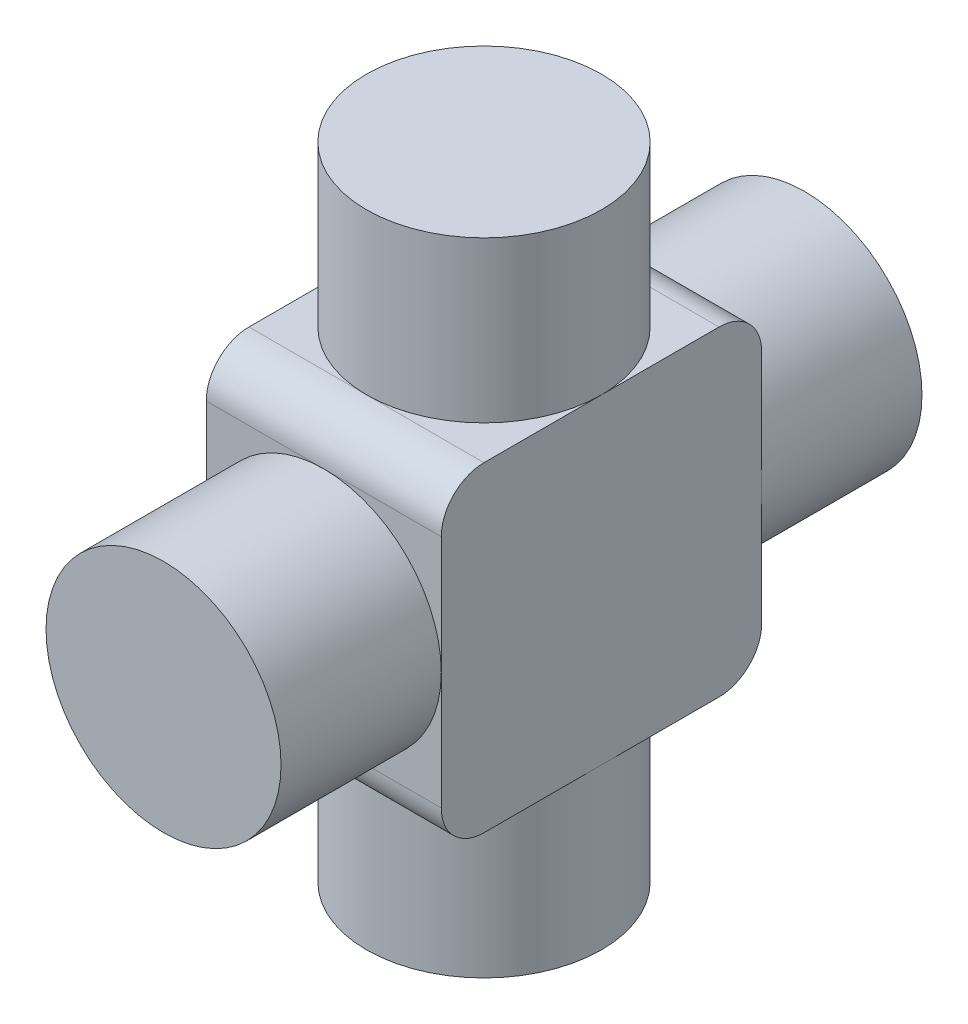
ISO-10303-21;
HEADER;
FILE_DESCRIPTION(('STEP AP214'),'2;1');
FILE_NAME('part.step','',(''),(''),'','','');
FILE_SCHEMA(('AUTOMOTIVE_DESIGN { 1 0 10303 214 1 1 1 1 }'));
ENDSEC;
DATA;
#1=APPLICATION_CONTEXT('core data for automotive mechanical design processes');
#2=APPLICATION_PROTOCOL_DEFINITION('international standard','automotive_design',2000,#1);
#3=PRODUCT_CONTEXT('',#1,'mechanical');
#4=PRODUCT('Part','Part','',(#3));
#5=PRODUCT_RELATED_PRODUCT_CATEGORY('part','',(#4));
#6=PRODUCT_DEFINITION_FORMATION('','',#4);
#7=PRODUCT_DEFINITION_CONTEXT('part definition',#1,'design');
#8=PRODUCT_DEFINITION('design','',#6,#7);
#9=PRODUCT_DEFINITION_SHAPE('','',#8);
#10=(LENGTH_UNIT() NAMED_UNIT(*) SI_UNIT(.MILLI.,.METRE.));
#11=(NAMED_UNIT(*) PLANE_ANGLE_UNIT() SI_UNIT($,.RADIAN.));
#12=(NAMED_UNIT(*) SI_UNIT($,.STERADIAN.) SOLID_ANGLE_UNIT());
#13=UNCERTAINTY_MEASURE_WITH_UNIT(LENGTH_MEASURE(1.E-05),#10,'distance_accuracy_value','');
#14=(GEOMETRIC_REPRESENTATION_CONTEXT(3) GLOBAL_UNCERTAINTY_ASSIGNED_CONTEXT((#13)) GLOBAL_UNIT_ASSIGNED_CONTEXT((#10,
#11,#12)) REPRESENTATION_CONTEXT('',''));
#15=CARTESIAN_POINT('',(0.,0.,0.));
#16=DIRECTION('',(0.,0.,1.));
#17=DIRECTION('',(1.,0.,0.));
#18=AXIS2_PLACEMENT_3D('',#15,#16,#17);
#19=CARTESIAN_POINT('',(-11.952627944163,15.,4.5210926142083));
#20=DIRECTION('',(0.,-1.,0.));
#21=DIRECTION('',(1.,0.,0.));
#22=AXIS2_PLACEMENT_3D('',#19,#20,#21);
#23=PLANE('',#22);
#24=CARTESIAN_POINT('',(0.,15.,15.));
#25=DIRECTION('',(0.,1.,0.));
#26=DIRECTION('',(0.,0.,1.));
#27=AXIS2_PLACEMENT_3D('',#24,#25,#26);
#28=CIRCLE('',#27,5.49999999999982);
#29=CARTESIAN_POINT('',(0.,15.,20.4999999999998));
#30=VERTEX_POINT('',#29);
#31=EDGE_CURVE('E21',#30,#30,#28,.T.);
#32=ORIENTED_EDGE('',*,*,#31,.T.);
#33=EDGE_LOOP('',(#32));
#34=FACE_BOUND('',#33,.T.);
#35=ADVANCED_FACE('F17',(#34),#23,.F.);
#36=CARTESIAN_POINT('',(-11.952627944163,-15.,4.5210926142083));
#37=DIRECTION('',(0.,-1.,0.));
#38=DIRECTION('',(1.,0.,0.));
#39=AXIS2_PLACEMENT_3D('',#36,#37,#38);
#40=PLANE('',#39);
#41=CARTESIAN_POINT('',(0.,-15.,15.));
#42=DIRECTION('',(0.,1.,0.));
#43=DIRECTION('',(0.,0.,1.));
#44=AXIS2_PLACEMENT_3D('',#41,#42,#43);
#45=CIRCLE('',#44,5.49999999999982);
#46=CARTESIAN_POINT('',(0.,-15.,20.4999999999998));
#47=VERTEX_POINT('',#46);
#48=EDGE_CURVE('E278',#47,#47,#45,.F.);
#49=ORIENTED_EDGE('',*,*,#48,.T.);
#50=EDGE_LOOP('',(#49));
#51=FACE_BOUND('',#50,.T.);
#52=ADVANCED_FACE('F298',(#51),#40,.T.);
#53=CARTESIAN_POINT('',(-8.25,-8.25,0.));
#54=DIRECTION('',(0.,0.,1.));
#55=DIRECTION('',(1.,0.,0.));
#56=AXIS2_PLACEMENT_3D('',#53,#54,#55);
#57=PLANE('',#56);
#58=CARTESIAN_POINT('',(0.,0.,0.));
#59=DIRECTION('',(0.,0.,1.));
#60=DIRECTION('',(1.,0.,0.));
#61=AXIS2_PLACEMENT_3D('',#58,#59,#60);
#62=CIRCLE('',#61,5.5);
#63=CARTESIAN_POINT('',(5.5,0.,0.));
#64=VERTEX_POINT('',#63);
#65=EDGE_CURVE('E276',#64,#64,#62,.T.);
#66=ORIENTED_EDGE('',*,*,#65,.F.);
#67=EDGE_LOOP('',(#66));
#68=FACE_BOUND('',#67,.T.);
#69=ADVANCED_FACE('F288',(#68),#57,.F.);
#70=CARTESIAN_POINT('',(0.,-15.,15.));
#71=DIRECTION('',(0.,1.,0.));
#72=DIRECTION('',(0.,0.,1.));
#73=AXIS2_PLACEMENT_3D('',#70,#71,#72);
#74=CYLINDRICAL_SURFACE('',#73,5.49999999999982);
#75=CARTESIAN_POINT('',(0.,7.5,15.));
#76=DIRECTION('',(0.,1.,0.));
#77=DIRECTION('',(0.,0.,1.));
#78=AXIS2_PLACEMENT_3D('',#75,#76,#77);
#79=CIRCLE('',#78,5.49999999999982);
#80=CARTESIAN_POINT('',(5.49999999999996,7.5,15.));
#81=VERTEX_POINT('',#80);
#82=CARTESIAN_POINT('',(0.,7.5,20.4999999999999));
#83=VERTEX_POINT('',#82);
#84=EDGE_CURVE('E149',#81,#83,#79,.F.);
#85=ORIENTED_EDGE('',*,*,#84,.F.);
#86=CARTESIAN_POINT('',(0.,7.5,15.));
#87=DIRECTION('',(0.,1.,0.));
#88=DIRECTION('',(0.,0.,1.));
#89=AXIS2_PLACEMENT_3D('',#86,#87,#88);
#90=CIRCLE('',#89,5.49999999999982);
#91=CARTESIAN_POINT('',(0.,7.5,9.50000000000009));
#92=VERTEX_POINT('',#91);
#93=EDGE_CURVE('E212',#92,#81,#90,.F.);
#94=ORIENTED_EDGE('',*,*,#93,.F.);
#95=CARTESIAN_POINT('',(0.,7.5,15.));
#96=DIRECTION('',(0.,1.,0.));
#97=DIRECTION('',(0.,0.,1.));
#98=AXIS2_PLACEMENT_3D('',#95,#96,#97);
#99=CIRCLE('',#98,5.49999999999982);
#100=CARTESIAN_POINT('',(-5.49999999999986,7.5,15.));
#101=VERTEX_POINT('',#100);
#102=EDGE_CURVE('E268',#101,#92,#99,.F.);
#103=ORIENTED_EDGE('',*,*,#102,.F.);
#104=CARTESIAN_POINT('',(0.,7.5,15.));
#105=DIRECTION('',(0.,1.,0.));
#106=DIRECTION('',(0.,0.,1.));
#107=AXIS2_PLACEMENT_3D('',#104,#105,#106);
#108=CIRCLE('',#107,5.49999999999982);
#109=EDGE_CURVE('E265',#83,#101,#108,.F.);
#110=ORIENTED_EDGE('',*,*,#109,.F.);
#111=EDGE_LOOP('',(#85,#94,#103,#110));
#112=FACE_BOUND('',#111,.T.);
#113=ORIENTED_EDGE('',*,*,#31,.F.);
#114=EDGE_LOOP('',(#113));
#115=FACE_BOUND('',#114,.T.);
#116=ADVANCED_FACE('F286',(#112,#115),#74,.T.);
#117=CARTESIAN_POINT('',(0.,-15.,15.));
#118=DIRECTION('',(0.,1.,0.));
#119=DIRECTION('',(0.,0.,1.));
#120=AXIS2_PLACEMENT_3D('',#117,#118,#119);
#121=CYLINDRICAL_SURFACE('',#120,5.49999999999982);
#122=CARTESIAN_POINT('',(0.,-7.5,15.));
#123=DIRECTION('',(0.,1.,0.));
#124=DIRECTION('',(0.,0.,1.));
#125=AXIS2_PLACEMENT_3D('',#122,#123,#124);
#126=CIRCLE('',#125,5.49999999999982);
#127=CARTESIAN_POINT('',(5.49999999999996,-7.5,15.));
#128=VERTEX_POINT('',#127);
#129=CARTESIAN_POINT('',(0.,-7.5,9.50000000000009));
#130=VERTEX_POINT('',#129);
#131=EDGE_CURVE('E127',#128,#130,#126,.T.);
#132=ORIENTED_EDGE('',*,*,#131,.F.);
#133=CARTESIAN_POINT('',(0.,-7.5,15.));
#134=DIRECTION('',(0.,1.,0.));
#135=DIRECTION('',(0.,0.,1.));
#136=AXIS2_PLACEMENT_3D('',#133,#134,#135);
#137=CIRCLE('',#136,5.49999999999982);
#138=CARTESIAN_POINT('',(0.,-7.5,20.4999999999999));
#139=VERTEX_POINT('',#138);
#140=EDGE_CURVE('E131',#139,#128,#137,.T.);
#141=ORIENTED_EDGE('',*,*,#140,.F.);
#142=CARTESIAN_POINT('',(0.,-7.5,15.));
#143=DIRECTION('',(0.,1.,0.));
#144=DIRECTION('',(0.,0.,1.));
#145=AXIS2_PLACEMENT_3D('',#142,#143,#144);
#146=CIRCLE('',#145,5.49999999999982);
#147=CARTESIAN_POINT('',(-5.49999999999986,-7.5,15.));
#148=VERTEX_POINT('',#147);
#149=EDGE_CURVE('E263',#148,#139,#146,.T.);
#150=ORIENTED_EDGE('',*,*,#149,.F.);
#151=CARTESIAN_POINT('',(0.,-7.5,15.));
#152=DIRECTION('',(0.,1.,0.));
#153=DIRECTION('',(0.,0.,1.));
#154=AXIS2_PLACEMENT_3D('',#151,#152,#153);
#155=CIRCLE('',#154,5.49999999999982);
#156=EDGE_CURVE('E134',#130,#148,#155,.T.);
#157=ORIENTED_EDGE('',*,*,#156,.F.);
#158=EDGE_LOOP('',(#132,#141,#150,#157));
#159=FACE_BOUND('',#158,.T.);
#160=ORIENTED_EDGE('',*,*,#48,.F.);
#161=EDGE_LOOP('',(#160));
#162=FACE_BOUND('',#161,.T.);
#163=ADVANCED_FACE('F129',(#159,#162),#121,.T.);
#164=CARTESIAN_POINT('',(0.,0.,0.));
#165=DIRECTION('',(0.,0.,1.));
#166=DIRECTION('',(1.,0.,0.));
#167=AXIS2_PLACEMENT_3D('',#164,#165,#166);
#168=CYLINDRICAL_SURFACE('',#167,5.5);
#169=CARTESIAN_POINT('',(0.,0.,7.5));
#170=DIRECTION('',(0.,0.,1.));
#171=DIRECTION('',(1.,0.,0.));
#172=AXIS2_PLACEMENT_3D('',#169,#170,#171);
#173=CIRCLE('',#172,5.5);
#174=CARTESIAN_POINT('',(5.5,0.,7.5));
#175=VERTEX_POINT('',#174);
#176=CARTESIAN_POINT('',(0.,5.5,7.5));
#177=VERTEX_POINT('',#176);
#178=EDGE_CURVE('E226',#175,#177,#173,.T.);
#179=ORIENTED_EDGE('',*,*,#178,.F.);
#180=CARTESIAN_POINT('',(0.,0.,7.5));
#181=DIRECTION('',(0.,0.,1.));
#182=DIRECTION('',(1.,0.,0.));
#183=AXIS2_PLACEMENT_3D('',#180,#181,#182);
#184=CIRCLE('',#183,5.5);
#185=CARTESIAN_POINT('',(0.,-5.5,7.5));
#186=VERTEX_POINT('',#185);
#187=EDGE_CURVE('E201',#186,#175,#184,.T.);
#188=ORIENTED_EDGE('',*,*,#187,.F.);
#189=CARTESIAN_POINT('',(0.,0.,7.5));
#190=DIRECTION('',(0.,0.,1.));
#191=DIRECTION('',(1.,0.,0.));
#192=AXIS2_PLACEMENT_3D('',#189,#190,#191);
#193=CIRCLE('',#192,5.5);
#194=CARTESIAN_POINT('',(-5.5,0.,7.5));
#195=VERTEX_POINT('',#194);
#196=EDGE_CURVE('E273',#195,#186,#193,.T.);
#197=ORIENTED_EDGE('',*,*,#196,.F.);
#198=CARTESIAN_POINT('',(0.,0.,7.5));
#199=DIRECTION('',(0.,0.,1.));
#200=DIRECTION('',(1.,0.,0.));
#201=AXIS2_PLACEMENT_3D('',#198,#199,#200);
#202=CIRCLE('',#201,5.5);
#203=EDGE_CURVE('E270',#177,#195,#202,.T.);
#204=ORIENTED_EDGE('',*,*,#203,.F.);
#205=EDGE_LOOP('',(#179,#188,#197,#204));
#206=FACE_BOUND('',#205,.T.);
#207=ORIENTED_EDGE('',*,*,#65,.T.);
#208=EDGE_LOOP('',(#207));
#209=FACE_BOUND('',#208,.T.);
#210=ADVANCED_FACE('F296',(#206,#209),#168,.T.);
#211=CARTESIAN_POINT('',(-5.5,-7.5,22.5));
#212=DIRECTION('',(0.,-1.,0.));
#213=DIRECTION('',(0.,0.,-1.));
#214=AXIS2_PLACEMENT_3D('',#211,#212,#213);
#215=PLANE('',#214);
#216=DIRECTION('',(-1.,0.,0.));
#217=VECTOR('',#216,1.);
#218=CARTESIAN_POINT('',(0.,-7.5,9.5));
#219=LINE('',#218,#217);
#220=CARTESIAN_POINT('',(-5.5,-7.5,9.5));
#221=VERTEX_POINT('',#220);
#222=EDGE_CURVE('E202',#130,#221,#219,.T.);
#223=ORIENTED_EDGE('',*,*,#222,.F.);
#224=ORIENTED_EDGE('',*,*,#156,.T.);
#225=DIRECTION('',(0.,0.,-1.));
#226=VECTOR('',#225,1.);
#227=CARTESIAN_POINT('',(-5.5,-7.5,15.));
#228=LINE('',#227,#226);
#229=EDGE_CURVE('E192',#148,#221,#228,.T.);
#230=ORIENTED_EDGE('',*,*,#229,.T.);
#231=EDGE_LOOP('',(#223,#224,#230));
#232=FACE_BOUND('',#231,.T.);
#233=ADVANCED_FACE('F409',(#232),#215,.T.);
#234=CARTESIAN_POINT('',(-5.5,-7.5,7.5));
#235=DIRECTION('',(0.,0.,-1.));
#236=DIRECTION('',(0.,1.,0.));
#237=AXIS2_PLACEMENT_3D('',#234,#235,#236);
#238=PLANE('',#237);
#239=DIRECTION('',(1.,0.,0.));
#240=VECTOR('',#239,1.);
#241=CARTESIAN_POINT('',(0.,-5.5,7.5));
#242=LINE('',#241,#240);
#243=CARTESIAN_POINT('',(-5.5,-5.5,7.5));
#244=VERTEX_POINT('',#243);
#245=EDGE_CURVE('E138',#244,#186,#242,.T.);
#246=ORIENTED_EDGE('',*,*,#245,.F.);
#247=DIRECTION('',(0.,1.,0.));
#248=VECTOR('',#247,1.);
#249=CARTESIAN_POINT('',(-5.5,0.,7.5));
#250=LINE('',#249,#248);
#251=EDGE_CURVE('E188',#244,#195,#250,.T.);
#252=ORIENTED_EDGE('',*,*,#251,.T.);
#253=ORIENTED_EDGE('',*,*,#196,.T.);
#254=EDGE_LOOP('',(#246,#252,#253));
#255=FACE_BOUND('',#254,.T.);
#256=ADVANCED_FACE('F402',(#255),#238,.T.);
#257=CARTESIAN_POINT('',(-5.5,-7.5,7.5));
#258=DIRECTION('',(0.,0.,-1.));
#259=DIRECTION('',(0.,1.,0.));
#260=AXIS2_PLACEMENT_3D('',#257,#258,#259);
#261=PLANE('',#260);
#262=DIRECTION('',(-1.,0.,0.));
#263=VECTOR('',#262,1.);
#264=CARTESIAN_POINT('',(0.,5.5,7.5));
#265=LINE('',#264,#263);
#266=CARTESIAN_POINT('',(-5.5,5.5,7.5));
#267=VERTEX_POINT('',#266);
#268=EDGE_CURVE('E213',#177,#267,#265,.T.);
#269=ORIENTED_EDGE('',*,*,#268,.F.);
#270=ORIENTED_EDGE('',*,*,#203,.T.);
#271=DIRECTION('',(0.,1.,0.));
#272=VECTOR('',#271,1.);
#273=CARTESIAN_POINT('',(-5.5,0.,7.5));
#274=LINE('',#273,#272);
#275=EDGE_CURVE('E186',#195,#267,#274,.T.);
#276=ORIENTED_EDGE('',*,*,#275,.T.);
#277=EDGE_LOOP('',(#269,#270,#276));
#278=FACE_BOUND('',#277,.T.);
#279=ADVANCED_FACE('F400',(#278),#261,.T.);
#280=CARTESIAN_POINT('',(-5.5,7.5,7.5));
#281=DIRECTION('',(0.,1.,0.));
#282=DIRECTION('',(0.,0.,1.));
#283=AXIS2_PLACEMENT_3D('',#280,#281,#282);
#284=PLANE('',#283);
#285=DIRECTION('',(1.,0.,0.));
#286=VECTOR('',#285,1.);
#287=CARTESIAN_POINT('',(0.,7.5,9.5));
#288=LINE('',#287,#286);
#289=CARTESIAN_POINT('',(-5.5,7.5,9.5));
#290=VERTEX_POINT('',#289);
#291=EDGE_CURVE('E217',#290,#92,#288,.T.);
#292=ORIENTED_EDGE('',*,*,#291,.F.);
#293=DIRECTION('',(0.,0.,1.));
#294=VECTOR('',#293,1.);
#295=CARTESIAN_POINT('',(-5.5,7.5,15.));
#296=LINE('',#295,#294);
#297=EDGE_CURVE('E182',#290,#101,#296,.T.);
#298=ORIENTED_EDGE('',*,*,#297,.T.);
#299=ORIENTED_EDGE('',*,*,#102,.T.);
#300=EDGE_LOOP('',(#292,#298,#299));
#301=FACE_BOUND('',#300,.T.);
#302=ADVANCED_FACE('F395',(#301),#284,.T.);
#303=CARTESIAN_POINT('',(-5.5,7.5,7.5));
#304=DIRECTION('',(0.,1.,0.));
#305=DIRECTION('',(0.,0.,1.));
#306=AXIS2_PLACEMENT_3D('',#303,#304,#305);
#307=PLANE('',#306);
#308=DIRECTION('',(-1.,0.,0.));
#309=VECTOR('',#308,1.);
#310=CARTESIAN_POINT('',(0.,7.5,20.5));
#311=LINE('',#310,#309);
#312=CARTESIAN_POINT('',(-5.5,7.5,20.5));
#313=VERTEX_POINT('',#312);
#314=EDGE_CURVE('E197',#83,#313,#311,.T.);
#315=ORIENTED_EDGE('',*,*,#314,.F.);
#316=ORIENTED_EDGE('',*,*,#109,.T.);
#317=DIRECTION('',(0.,0.,1.));
#318=VECTOR('',#317,1.);
#319=CARTESIAN_POINT('',(-5.5,7.5,15.));
#320=LINE('',#319,#318);
#321=EDGE_CURVE('E179',#101,#313,#320,.T.);
#322=ORIENTED_EDGE('',*,*,#321,.T.);
#323=EDGE_LOOP('',(#315,#316,#322));
#324=FACE_BOUND('',#323,.T.);
#325=ADVANCED_FACE('F393',(#324),#307,.T.);
#326=CARTESIAN_POINT('',(-5.5,-7.5,22.5));
#327=DIRECTION('',(0.,-1.,0.));
#328=DIRECTION('',(0.,0.,-1.));
#329=AXIS2_PLACEMENT_3D('',#326,#327,#328);
#330=PLANE('',#329);
#331=DIRECTION('',(1.,0.,0.));
#332=VECTOR('',#331,1.);
#333=CARTESIAN_POINT('',(0.,-7.5,20.5));
#334=LINE('',#333,#332);
#335=CARTESIAN_POINT('',(-5.5,-7.5,20.5));
#336=VERTEX_POINT('',#335);
#337=EDGE_CURVE('E205',#336,#139,#334,.T.);
#338=ORIENTED_EDGE('',*,*,#337,.F.);
#339=DIRECTION('',(0.,0.,-1.));
#340=VECTOR('',#339,1.);
#341=CARTESIAN_POINT('',(-5.5,-7.5,15.));
#342=LINE('',#341,#340);
#343=EDGE_CURVE('E194',#336,#148,#342,.T.);
#344=ORIENTED_EDGE('',*,*,#343,.T.);
#345=ORIENTED_EDGE('',*,*,#149,.T.);
#346=EDGE_LOOP('',(#338,#344,#345));
#347=FACE_BOUND('',#346,.T.);
#348=ADVANCED_FACE('F416',(#347),#330,.T.);
#349=CARTESIAN_POINT('',(-5.5,-7.5,7.5));
#350=DIRECTION('',(0.,0.,-1.));
#351=DIRECTION('',(0.,1.,0.));
#352=AXIS2_PLACEMENT_3D('',#349,#350,#351);
#353=PLANE('',#352);
#354=DIRECTION('',(-1.,0.,0.));
#355=VECTOR('',#354,1.);
#356=CARTESIAN_POINT('',(0.,5.5,7.5));
#357=LINE('',#356,#355);
#358=CARTESIAN_POINT('',(5.5,5.5,7.5));
#359=VERTEX_POINT('',#358);
#360=EDGE_CURVE('E214',#359,#177,#357,.T.);
#361=ORIENTED_EDGE('',*,*,#360,.F.);
#362=DIRECTION('',(0.,1.,0.));
#363=VECTOR('',#362,1.);
#364=CARTESIAN_POINT('',(5.5,0.,7.5));
#365=LINE('',#364,#363);
#366=EDGE_CURVE('E176',#175,#359,#365,.T.);
#367=ORIENTED_EDGE('',*,*,#366,.F.);
#368=ORIENTED_EDGE('',*,*,#178,.T.);
#369=EDGE_LOOP('',(#361,#367,#368));
#370=FACE_BOUND('',#369,.T.);
#371=ADVANCED_FACE('F370',(#370),#353,.T.);
#372=CARTESIAN_POINT('',(-5.5,5.5,9.5));
#373=DIRECTION('',(1.,0.,0.));
#374=DIRECTION('',(0.,0.,-1.));
#375=AXIS2_PLACEMENT_3D('',#372,#373,#374);
#376=CYLINDRICAL_SURFACE('',#375,2.);
#377=ORIENTED_EDGE('',*,*,#360,.T.);
#378=ORIENTED_EDGE('',*,*,#268,.T.);
#379=CARTESIAN_POINT('',(-5.5,5.5,9.5));
#380=DIRECTION('',(1.,0.,0.));
#381=DIRECTION('',(0.,0.,-1.));
#382=AXIS2_PLACEMENT_3D('',#379,#380,#381);
#383=CIRCLE('',#382,2.);
#384=EDGE_CURVE('E185',#267,#290,#383,.T.);
#385=ORIENTED_EDGE('',*,*,#384,.T.);
#386=ORIENTED_EDGE('',*,*,#291,.T.);
#387=DIRECTION('',(-1.,0.,0.));
#388=VECTOR('',#387,1.);
#389=CARTESIAN_POINT('',(0.,7.5,9.5));
#390=LINE('',#389,#388);
#391=CARTESIAN_POINT('',(5.5,7.5,9.5));
#392=VERTEX_POINT('',#391);
#393=EDGE_CURVE('E209',#392,#92,#390,.T.);
#394=ORIENTED_EDGE('',*,*,#393,.F.);
#395=CARTESIAN_POINT('',(5.5,5.5,9.5));
#396=DIRECTION('',(1.,0.,0.));
#397=DIRECTION('',(0.,0.,-1.));
#398=AXIS2_PLACEMENT_3D('',#395,#396,#397);
#399=CIRCLE('',#398,2.);
#400=EDGE_CURVE('E175',#359,#392,#399,.T.);
#401=ORIENTED_EDGE('',*,*,#400,.F.);
#402=EDGE_LOOP('',(#377,#378,#385,#386,#394,#401));
#403=FACE_BOUND('',#402,.T.);
#404=ADVANCED_FACE('F373',(#403),#376,.T.);
#405=CARTESIAN_POINT('',(-5.5,7.5,7.5));
#406=DIRECTION('',(0.,1.,0.));
#407=DIRECTION('',(0.,0.,1.));
#408=AXIS2_PLACEMENT_3D('',#405,#406,#407);
#409=PLANE('',#408);
#410=ORIENTED_EDGE('',*,*,#393,.T.);
#411=ORIENTED_EDGE('',*,*,#93,.T.);
#412=DIRECTION('',(0.,0.,1.));
#413=VECTOR('',#412,1.);
#414=CARTESIAN_POINT('',(5.5,7.5,15.));
#415=LINE('',#414,#413);
#416=EDGE_CURVE('E172',#392,#81,#415,.T.);
#417=ORIENTED_EDGE('',*,*,#416,.F.);
#418=EDGE_LOOP('',(#410,#411,#417));
#419=FACE_BOUND('',#418,.T.);
#420=ADVANCED_FACE('F377',(#419),#409,.T.);
#421=CARTESIAN_POINT('',(-5.5,7.5,7.5));
#422=DIRECTION('',(0.,1.,0.));
#423=DIRECTION('',(0.,0.,1.));
#424=AXIS2_PLACEMENT_3D('',#421,#422,#423);
#425=PLANE('',#424);
#426=DIRECTION('',(-1.,0.,0.));
#427=VECTOR('',#426,1.);
#428=CARTESIAN_POINT('',(0.,7.5,20.5));
#429=LINE('',#428,#427);
#430=CARTESIAN_POINT('',(5.5,7.5,20.5));
#431=VERTEX_POINT('',#430);
#432=EDGE_CURVE('E206',#431,#83,#429,.T.);
#433=ORIENTED_EDGE('',*,*,#432,.F.);
#434=DIRECTION('',(0.,0.,1.));
#435=VECTOR('',#434,1.);
#436=CARTESIAN_POINT('',(5.5,7.5,15.));
#437=LINE('',#436,#435);
#438=EDGE_CURVE('E169',#81,#431,#437,.T.);
#439=ORIENTED_EDGE('',*,*,#438,.F.);
#440=ORIENTED_EDGE('',*,*,#84,.T.);
#441=EDGE_LOOP('',(#433,#439,#440));
#442=FACE_BOUND('',#441,.T.);
#443=ADVANCED_FACE('F380',(#442),#425,.T.);
#444=CARTESIAN_POINT('',(-5.5,-7.5,22.5));
#445=DIRECTION('',(0.,-1.,0.));
#446=DIRECTION('',(0.,0.,-1.));
#447=AXIS2_PLACEMENT_3D('',#444,#445,#446);
#448=PLANE('',#447);
#449=DIRECTION('',(1.,0.,0.));
#450=VECTOR('',#449,1.);
#451=CARTESIAN_POINT('',(0.,-7.5,20.5));
#452=LINE('',#451,#450);
#453=CARTESIAN_POINT('',(5.5,-7.5,20.5));
#454=VERTEX_POINT('',#453);
#455=EDGE_CURVE('E147',#139,#454,#452,.T.);
#456=ORIENTED_EDGE('',*,*,#455,.F.);
#457=ORIENTED_EDGE('',*,*,#140,.T.);
#458=DIRECTION('',(0.,0.,-1.));
#459=VECTOR('',#458,1.);
#460=CARTESIAN_POINT('',(5.5,-7.5,15.));
#461=LINE('',#460,#459);
#462=EDGE_CURVE('E145',#454,#128,#461,.T.);
#463=ORIENTED_EDGE('',*,*,#462,.F.);
#464=EDGE_LOOP('',(#456,#457,#463));
#465=FACE_BOUND('',#464,.T.);
#466=ADVANCED_FACE('F143',(#465),#448,.T.);
#467=CARTESIAN_POINT('',(-5.5,-7.5,22.5));
#468=DIRECTION('',(0.,-1.,0.));
#469=DIRECTION('',(0.,0.,-1.));
#470=AXIS2_PLACEMENT_3D('',#467,#468,#469);
#471=PLANE('',#470);
#472=DIRECTION('',(-1.,0.,0.));
#473=VECTOR('',#472,1.);
#474=CARTESIAN_POINT('',(0.,-7.5,9.5));
#475=LINE('',#474,#473);
#476=CARTESIAN_POINT('',(5.5,-7.5,9.5));
#477=VERTEX_POINT('',#476);
#478=EDGE_CURVE('E155',#477,#130,#475,.T.);
#479=ORIENTED_EDGE('',*,*,#478,.F.);
#480=DIRECTION('',(0.,0.,-1.));
#481=VECTOR('',#480,1.);
#482=CARTESIAN_POINT('',(5.5,-7.5,15.));
#483=LINE('',#482,#481);
#484=EDGE_CURVE('E152',#128,#477,#483,.T.);
#485=ORIENTED_EDGE('',*,*,#484,.F.);
#486=ORIENTED_EDGE('',*,*,#131,.T.);
#487=EDGE_LOOP('',(#479,#485,#486));
#488=FACE_BOUND('',#487,.T.);
#489=ADVANCED_FACE('F153',(#488),#471,.T.);
#490=CARTESIAN_POINT('',(-5.5,-5.5,9.5));
#491=DIRECTION('',(1.,0.,0.));
#492=DIRECTION('',(0.,0.,-1.));
#493=AXIS2_PLACEMENT_3D('',#490,#491,#492);
#494=CYLINDRICAL_SURFACE('',#493,2.);
#495=ORIENTED_EDGE('',*,*,#478,.T.);
#496=ORIENTED_EDGE('',*,*,#222,.T.);
#497=CARTESIAN_POINT('',(-5.5,-5.5,9.5));
#498=DIRECTION('',(1.,0.,0.));
#499=DIRECTION('',(0.,0.,-1.));
#500=AXIS2_PLACEMENT_3D('',#497,#498,#499);
#501=CIRCLE('',#500,2.);
#502=EDGE_CURVE('E191',#221,#244,#501,.T.);
#503=ORIENTED_EDGE('',*,*,#502,.T.);
#504=ORIENTED_EDGE('',*,*,#245,.T.);
#505=DIRECTION('',(-1.,0.,0.));
#506=VECTOR('',#505,1.);
#507=CARTESIAN_POINT('',(0.,-5.5,7.5));
#508=LINE('',#507,#506);
#509=CARTESIAN_POINT('',(5.5,-5.5,7.5));
#510=VERTEX_POINT('',#509);
#511=EDGE_CURVE('E198',#510,#186,#508,.T.);
#512=ORIENTED_EDGE('',*,*,#511,.F.);
#513=CARTESIAN_POINT('',(5.5,-5.5,9.5));
#514=DIRECTION('',(1.,0.,0.));
#515=DIRECTION('',(0.,0.,-1.));
#516=AXIS2_PLACEMENT_3D('',#513,#514,#515);
#517=CIRCLE('',#516,2.);
#518=EDGE_CURVE('E159',#477,#510,#517,.T.);
#519=ORIENTED_EDGE('',*,*,#518,.F.);
#520=EDGE_LOOP('',(#495,#496,#503,#504,#512,#519));
#521=FACE_BOUND('',#520,.T.);
#522=ADVANCED_FACE('F432',(#521),#494,.T.);
#523=CARTESIAN_POINT('',(-5.5,-7.5,7.5));
#524=DIRECTION('',(0.,0.,-1.));
#525=DIRECTION('',(0.,1.,0.));
#526=AXIS2_PLACEMENT_3D('',#523,#524,#525);
#527=PLANE('',#526);
#528=ORIENTED_EDGE('',*,*,#511,.T.);
#529=ORIENTED_EDGE('',*,*,#187,.T.);
#530=DIRECTION('',(0.,1.,0.));
#531=VECTOR('',#530,1.);
#532=CARTESIAN_POINT('',(5.5,0.,7.5));
#533=LINE('',#532,#531);
#534=EDGE_CURVE('E243',#510,#175,#533,.T.);
#535=ORIENTED_EDGE('',*,*,#534,.F.);
#536=EDGE_LOOP('',(#528,#529,#535));
#537=FACE_BOUND('',#536,.T.);
#538=ADVANCED_FACE('F364',(#537),#527,.T.);
#539=CARTESIAN_POINT('',(-5.5,5.5,20.5));
#540=DIRECTION('',(1.,0.,0.));
#541=DIRECTION('',(0.,0.,-1.));
#542=AXIS2_PLACEMENT_3D('',#539,#540,#541);
#543=CYLINDRICAL_SURFACE('',#542,2.);
#544=ORIENTED_EDGE('',*,*,#432,.T.);
#545=ORIENTED_EDGE('',*,*,#314,.T.);
#546=CARTESIAN_POINT('',(-5.5,5.5,20.5));
#547=DIRECTION('',(1.,0.,0.));
#548=DIRECTION('',(0.,0.,-1.));
#549=AXIS2_PLACEMENT_3D('',#546,#547,#548);
#550=CIRCLE('',#549,2.);
#551=CARTESIAN_POINT('',(-5.5,5.5,22.5));
#552=VERTEX_POINT('',#551);
#553=EDGE_CURVE('E181',#313,#552,#550,.T.);
#554=ORIENTED_EDGE('',*,*,#553,.T.);
#555=DIRECTION('',(-1.,0.,0.));
#556=VECTOR('',#555,1.);
#557=CARTESIAN_POINT('',(0.,5.5,22.5));
#558=LINE('',#557,#556);
#559=CARTESIAN_POINT('',(0.,5.5,22.5));
#560=VERTEX_POINT('',#559);
#561=EDGE_CURVE('E346',#560,#552,#558,.T.);
#562=ORIENTED_EDGE('',*,*,#561,.F.);
#563=DIRECTION('',(-1.,0.,0.));
#564=VECTOR('',#563,1.);
#565=CARTESIAN_POINT('',(0.,5.5,22.5));
#566=LINE('',#565,#564);
#567=CARTESIAN_POINT('',(5.5,5.5,22.5));
#568=VERTEX_POINT('',#567);
#569=EDGE_CURVE('E353',#568,#560,#566,.T.);
#570=ORIENTED_EDGE('',*,*,#569,.F.);
#571=CARTESIAN_POINT('',(5.5,5.5,20.5));
#572=DIRECTION('',(1.,0.,0.));
#573=DIRECTION('',(0.,0.,-1.));
#574=AXIS2_PLACEMENT_3D('',#571,#572,#573);
#575=CIRCLE('',#574,2.);
#576=EDGE_CURVE('E165',#431,#568,#575,.T.);
#577=ORIENTED_EDGE('',*,*,#576,.F.);
#578=EDGE_LOOP('',(#544,#545,#554,#562,#570,#577));
#579=FACE_BOUND('',#578,.T.);
#580=ADVANCED_FACE('F385',(#579),#543,.T.);
#581=CARTESIAN_POINT('',(-5.5,-8.25,6.75));
#582=DIRECTION('',(1.,0.,0.));
#583=DIRECTION('',(0.,1.,0.));
#584=AXIS2_PLACEMENT_3D('',#581,#582,#583);
#585=PLANE('',#584);
#586=ORIENTED_EDGE('',*,*,#553,.F.);
#587=ORIENTED_EDGE('',*,*,#321,.F.);
#588=ORIENTED_EDGE('',*,*,#297,.F.);
#589=ORIENTED_EDGE('',*,*,#384,.F.);
#590=ORIENTED_EDGE('',*,*,#275,.F.);
#591=ORIENTED_EDGE('',*,*,#251,.F.);
#592=ORIENTED_EDGE('',*,*,#502,.F.);
#593=ORIENTED_EDGE('',*,*,#229,.F.);
#594=ORIENTED_EDGE('',*,*,#343,.F.);
#595=CARTESIAN_POINT('',(-5.5,-5.5,20.5));
#596=DIRECTION('',(1.,0.,0.));
#597=DIRECTION('',(0.,0.,-1.));
#598=AXIS2_PLACEMENT_3D('',#595,#596,#597);
#599=CIRCLE('',#598,2.);
#600=CARTESIAN_POINT('',(-5.5,-5.5,22.5));
#601=VERTEX_POINT('',#600);
#602=EDGE_CURVE('E219',#601,#336,#599,.T.);
#603=ORIENTED_EDGE('',*,*,#602,.F.);
#604=DIRECTION('',(0.,-1.,0.));
#605=VECTOR('',#604,1.);
#606=CARTESIAN_POINT('',(-5.5,0.,22.5));
#607=LINE('',#606,#605);
#608=CARTESIAN_POINT('',(-5.5,0.,22.5));
#609=VERTEX_POINT('',#608);
#610=EDGE_CURVE('E339',#609,#601,#607,.T.);
#611=ORIENTED_EDGE('',*,*,#610,.F.);
#612=DIRECTION('',(0.,-1.,0.));
#613=VECTOR('',#612,1.);
#614=CARTESIAN_POINT('',(-5.5,0.,22.5));
#615=LINE('',#614,#613);
#616=EDGE_CURVE('E348',#552,#609,#615,.T.);
#617=ORIENTED_EDGE('',*,*,#616,.F.);
#618=EDGE_LOOP('',(#586,#587,#588,#589,#590,#591,#592,#593,#594,#603,#611,#617));
#619=FACE_BOUND('',#618,.T.);
#620=ADVANCED_FACE('F389',(#619),#585,.F.);
#621=CARTESIAN_POINT('',(-5.5,-5.5,20.5));
#622=DIRECTION('',(1.,0.,0.));
#623=DIRECTION('',(0.,0.,-1.));
#624=AXIS2_PLACEMENT_3D('',#621,#622,#623);
#625=CYLINDRICAL_SURFACE('',#624,2.);
#626=DIRECTION('',(1.,0.,0.));
#627=VECTOR('',#626,1.);
#628=CARTESIAN_POINT('',(0.,-5.5,22.5));
#629=LINE('',#628,#627);
#630=CARTESIAN_POINT('',(1.80239141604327E-13,-5.5,22.5));
#631=VERTEX_POINT('',#630);
#632=CARTESIAN_POINT('',(5.5,-5.5,22.5));
#633=VERTEX_POINT('',#632);
#634=EDGE_CURVE('E36',#631,#633,#629,.T.);
#635=ORIENTED_EDGE('',*,*,#634,.F.);
#636=DIRECTION('',(1.,0.,0.));
#637=VECTOR('',#636,1.);
#638=CARTESIAN_POINT('',(0.,-5.5,22.5));
#639=LINE('',#638,#637);
#640=EDGE_CURVE('E338',#601,#631,#639,.T.);
#641=ORIENTED_EDGE('',*,*,#640,.F.);
#642=ORIENTED_EDGE('',*,*,#602,.T.);
#643=ORIENTED_EDGE('',*,*,#337,.T.);
#644=ORIENTED_EDGE('',*,*,#455,.T.);
#645=CARTESIAN_POINT('',(5.5,-5.5,20.5));
#646=DIRECTION('',(1.,0.,0.));
#647=DIRECTION('',(0.,0.,-1.));
#648=AXIS2_PLACEMENT_3D('',#645,#646,#647);
#649=CIRCLE('',#648,2.);
#650=EDGE_CURVE('E163',#633,#454,#649,.T.);
#651=ORIENTED_EDGE('',*,*,#650,.F.);
#652=EDGE_LOOP('',(#635,#641,#642,#643,#644,#651));
#653=FACE_BOUND('',#652,.T.);
#654=ADVANCED_FACE('F325',(#653),#625,.T.);
#655=CARTESIAN_POINT('',(5.5,-8.25,6.75));
#656=DIRECTION('',(1.,0.,0.));
#657=DIRECTION('',(0.,1.,0.));
#658=AXIS2_PLACEMENT_3D('',#655,#656,#657);
#659=PLANE('',#658);
#660=ORIENTED_EDGE('',*,*,#518,.T.);
#661=ORIENTED_EDGE('',*,*,#534,.T.);
#662=ORIENTED_EDGE('',*,*,#366,.T.);
#663=ORIENTED_EDGE('',*,*,#400,.T.);
#664=ORIENTED_EDGE('',*,*,#416,.T.);
#665=ORIENTED_EDGE('',*,*,#438,.T.);
#666=ORIENTED_EDGE('',*,*,#576,.T.);
#667=DIRECTION('',(0.,1.,0.));
#668=VECTOR('',#667,1.);
#669=CARTESIAN_POINT('',(5.5,0.,22.5));
#670=LINE('',#669,#668);
#671=CARTESIAN_POINT('',(5.5,0.,22.5));
#672=VERTEX_POINT('',#671);
#673=EDGE_CURVE('E358',#672,#568,#670,.T.);
#674=ORIENTED_EDGE('',*,*,#673,.F.);
#675=DIRECTION('',(0.,1.,0.));
#676=VECTOR('',#675,1.);
#677=CARTESIAN_POINT('',(5.5,0.,22.5));
#678=LINE('',#677,#676);
#679=EDGE_CURVE('E242',#633,#672,#678,.T.);
#680=ORIENTED_EDGE('',*,*,#679,.F.);
#681=ORIENTED_EDGE('',*,*,#650,.T.);
#682=ORIENTED_EDGE('',*,*,#462,.T.);
#683=ORIENTED_EDGE('',*,*,#484,.T.);
#684=EDGE_LOOP('',(#660,#661,#662,#663,#664,#665,#666,#674,#680,#681,#682,#683));
#685=FACE_BOUND('',#684,.T.);
#686=ADVANCED_FACE('F161',(#685),#659,.T.);
#687=CARTESIAN_POINT('',(-8.25,-8.25,30.));
#688=DIRECTION('',(0.,0.,1.));
#689=DIRECTION('',(1.,0.,0.));
#690=AXIS2_PLACEMENT_3D('',#687,#688,#689);
#691=PLANE('',#690);
#692=CARTESIAN_POINT('',(0.,0.,30.));
#693=DIRECTION('',(0.,0.,1.));
#694=DIRECTION('',(1.,0.,0.));
#695=AXIS2_PLACEMENT_3D('',#692,#693,#694);
#696=CIRCLE('',#695,5.5);
#697=CARTESIAN_POINT('',(5.5,0.,30.));
#698=VERTEX_POINT('',#697);
#699=EDGE_CURVE('E239',#698,#698,#696,.F.);
#700=ORIENTED_EDGE('',*,*,#699,.F.);
#701=EDGE_LOOP('',(#700));
#702=FACE_BOUND('',#701,.T.);
#703=ADVANCED_FACE('F314',(#702),#691,.T.);
#704=CARTESIAN_POINT('',(-5.5,7.5,22.5));
#705=DIRECTION('',(0.,0.,1.));
#706=DIRECTION('',(0.,-1.,0.));
#707=AXIS2_PLACEMENT_3D('',#704,#705,#706);
#708=PLANE('',#707);
#709=ORIENTED_EDGE('',*,*,#569,.T.);
#710=CARTESIAN_POINT('',(0.,0.,22.5));
#711=DIRECTION('',(0.,0.,1.));
#712=DIRECTION('',(1.,0.,0.));
#713=AXIS2_PLACEMENT_3D('',#710,#711,#712);
#714=CIRCLE('',#713,5.5);
#715=EDGE_CURVE('E236',#672,#560,#714,.T.);
#716=ORIENTED_EDGE('',*,*,#715,.F.);
#717=ORIENTED_EDGE('',*,*,#673,.T.);
#718=EDGE_LOOP('',(#709,#716,#717));
#719=FACE_BOUND('',#718,.T.);
#720=ADVANCED_FACE('F316',(#719),#708,.T.);
#721=CARTESIAN_POINT('',(-5.5,7.5,22.5));
#722=DIRECTION('',(0.,0.,1.));
#723=DIRECTION('',(0.,-1.,0.));
#724=AXIS2_PLACEMENT_3D('',#721,#722,#723);
#725=PLANE('',#724);
#726=ORIENTED_EDGE('',*,*,#561,.T.);
#727=ORIENTED_EDGE('',*,*,#616,.T.);
#728=CARTESIAN_POINT('',(0.,0.,22.5));
#729=DIRECTION('',(0.,0.,1.));
#730=DIRECTION('',(1.,0.,0.));
#731=AXIS2_PLACEMENT_3D('',#728,#729,#730);
#732=CIRCLE('',#731,5.5);
#733=EDGE_CURVE('E233',#560,#609,#732,.T.);
#734=ORIENTED_EDGE('',*,*,#733,.F.);
#735=EDGE_LOOP('',(#726,#727,#734));
#736=FACE_BOUND('',#735,.T.);
#737=ADVANCED_FACE('F322',(#736),#725,.T.);
#738=CARTESIAN_POINT('',(-5.5,7.5,22.5));
#739=DIRECTION('',(0.,0.,1.));
#740=DIRECTION('',(0.,-1.,0.));
#741=AXIS2_PLACEMENT_3D('',#738,#739,#740);
#742=PLANE('',#741);
#743=ORIENTED_EDGE('',*,*,#640,.T.);
#744=CARTESIAN_POINT('',(0.,0.,22.5));
#745=DIRECTION('',(0.,0.,1.));
#746=DIRECTION('',(1.,0.,0.));
#747=AXIS2_PLACEMENT_3D('',#744,#745,#746);
#748=CIRCLE('',#747,5.5);
#749=EDGE_CURVE('E27',#609,#631,#748,.T.);
#750=ORIENTED_EDGE('',*,*,#749,.F.);
#751=ORIENTED_EDGE('',*,*,#610,.T.);
#752=EDGE_LOOP('',(#743,#750,#751));
#753=FACE_BOUND('',#752,.T.);
#754=ADVANCED_FACE('F308',(#753),#742,.T.);
#755=CARTESIAN_POINT('',(-5.5,7.5,22.5));
#756=DIRECTION('',(0.,0.,1.));
#757=DIRECTION('',(0.,-1.,0.));
#758=AXIS2_PLACEMENT_3D('',#755,#756,#757);
#759=PLANE('',#758);
#760=ORIENTED_EDGE('',*,*,#634,.T.);
#761=ORIENTED_EDGE('',*,*,#679,.T.);
#762=CARTESIAN_POINT('',(0.,0.,22.5));
#763=DIRECTION('',(0.,0.,1.));
#764=DIRECTION('',(1.,0.,0.));
#765=AXIS2_PLACEMENT_3D('',#762,#763,#764);
#766=CIRCLE('',#765,5.5);
#767=EDGE_CURVE('E11',#631,#672,#766,.T.);
#768=ORIENTED_EDGE('',*,*,#767,.F.);
#769=EDGE_LOOP('',(#760,#761,#768));
#770=FACE_BOUND('',#769,.T.);
#771=ADVANCED_FACE('F303',(#770),#759,.T.);
#772=CARTESIAN_POINT('',(0.,0.,0.));
#773=DIRECTION('',(0.,0.,1.));
#774=DIRECTION('',(1.,0.,0.));
#775=AXIS2_PLACEMENT_3D('',#772,#773,#774);
#776=CYLINDRICAL_SURFACE('',#775,5.5);
#777=ORIENTED_EDGE('',*,*,#767,.T.);
#778=ORIENTED_EDGE('',*,*,#715,.T.);
#779=ORIENTED_EDGE('',*,*,#733,.T.);
#780=ORIENTED_EDGE('',*,*,#749,.T.);
#781=EDGE_LOOP('',(#777,#778,#779,#780));
#782=FACE_BOUND('',#781,.T.);
#783=ORIENTED_EDGE('',*,*,#699,.T.);
#784=EDGE_LOOP('',(#783));
#785=FACE_BOUND('',#784,.T.);
#786=ADVANCED_FACE('F19',(#782,#785),#776,.T.);
#787=CLOSED_SHELL('',(#35,#52,#69,#116,#163,#210,#233,#256,#279,#302,#325,#348,#371,#404,#420,
#443,#466,#489,#522,#538,#580,#620,#654,#686,#703,#720,#737,#754,#771,#786));
#788=MANIFOLD_SOLID_BREP('B1',#787);
#789=ADVANCED_BREP_SHAPE_REPRESENTATION('',(#18,#788),#14);
#790=SHAPE_DEFINITION_REPRESENTATION(#9,#789);
ENDSEC;
END-ISO-10303-21;
